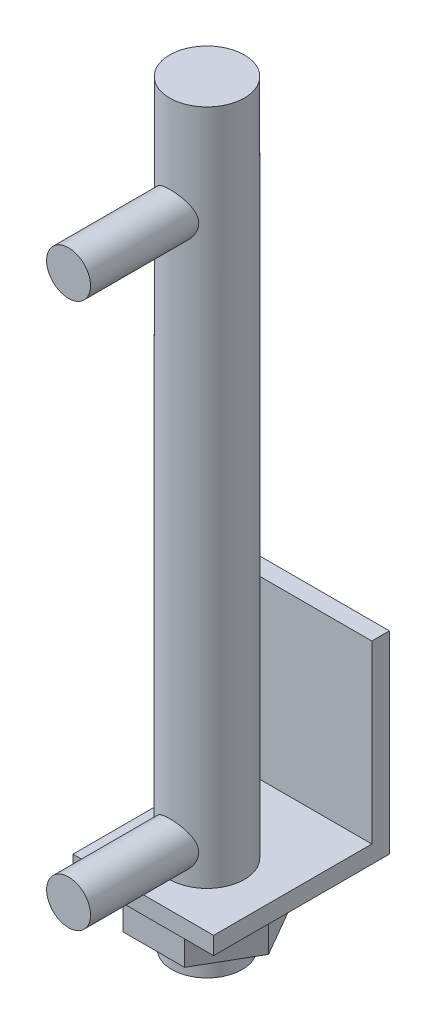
from build123d import *

# Parameters (mm, degrees)
SKIZZE1_R               = 8.5
LINEAR_AUSTRAGEN1_DEPTH = 154
SKIZZE3_W               = 32
SKIZZE3_H               = 40
LINEAR_AUSTRAGEN2_DEPTH = 4
SKIZZE4_W               = 32
SKIZZE4_H               = 4
LINEAR_AUSTRAGEN3_DEPTH = 40
LINEAR_AUSTRAGEN4_DEPTH = 8
SKIZZE6_R               = 8
LINEAR_AUSTRAGEN5_DEPTH = 14
SKIZZE8_R               = 5
LINEAR_AUSTRAGEN6_DEPTH = 31.5
LINEARES_MUSTER1_COUNT  = 2
LINEARES_MUSTER1_PITCH  = 124


with BuildPart() as part:
    # Skizze1 → Linear austragen1 (new body)
    with BuildSketch(Plane(origin=(0, 0, 0), x_dir=(1, 0, 0), z_dir=(0, 1, 0))):
        with Locations(Location((0, 0, 0), (0, 0, 270))):
            Circle(SKIZZE1_R)
    extrude(amount=LINEAR_AUSTRAGEN1_DEPTH)

    # Skizze3 → Linear austragen2 (add)
    with BuildSketch(Plane.XZ):
        with Locations((0, -5.5)):
            Rectangle(SKIZZE3_W, SKIZZE3_H)
    extrude(amount=LINEAR_AUSTRAGEN2_DEPTH)

    # Skizze4 → Linear austragen3 (add)
    with BuildSketch(Plane(origin=(0, 0, 0), x_dir=(1, 0, 0), z_dir=(0, 1, 0))):
        with Locations((0, 23.5)):
            Rectangle(SKIZZE4_W, SKIZZE4_H)
    extrude(amount=LINEAR_AUSTRAGEN3_DEPTH)

    # Skizze5 → Linear austragen4 (add)
    with BuildSketch(Plane.XZ.offset(4)):
        Polygon((14, 0), (7, 12.124355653), (-7, 12.124355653), (-14, 0), (-7, -12.124355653), (7, -12.124355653), align=None)
    extrude(amount=LINEAR_AUSTRAGEN4_DEPTH)

    # Skizze6 → Linear austragen5 (add)
    with BuildSketch(Plane.XZ.offset(4)):
        with Locations(Location((0, 0, 0), (0, 0, 270))):
            Circle(SKIZZE6_R)
    extrude(amount=LINEAR_AUSTRAGEN5_DEPTH)

    # Skizze8 → Linear austragen6 (add)
    with BuildSketch(Plane.XY):
        with Locations(Location((0, 7, 0), (0, 0, 180))):
            Circle(SKIZZE8_R)
    linear_austragen6 = extrude(amount=LINEAR_AUSTRAGEN6_DEPTH)

    # Lineares Muster1: Linear austragen6 ×2
    with Locations(*[(0, i * LINEARES_MUSTER1_PITCH, 0) for i in range(1, LINEARES_MUSTER1_COUNT)]):
        add(linear_austragen6)


solid = part.part
